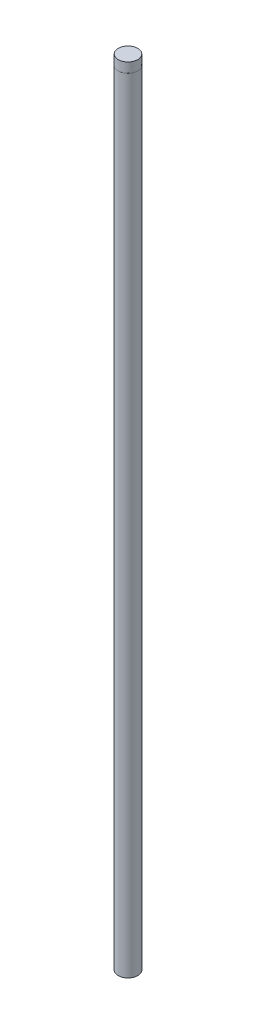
from build123d import *

# Parameters (mm, degrees)
SKETCH1_W = 4.99
SKETCH1_H = 5


with BuildPart() as part:
    # Sketch1 → Revolve1 (revolve)
    with BuildSketch(Plane.XY, mode=Mode.PRIVATE) as revolve1_sk:
        Polygon((0, 486), (5, 486), (5, 886), (4.99, 886), (0, 886), align=None)
        with Locations((2.495, 888.5)):
            Rectangle(SKETCH1_W, SKETCH1_H)
    revolve(revolve1_sk.sketch.rotate(Axis((0, 886, 0), (0, -1, 0)), 180), axis=Axis((0, 886, 0), (0, -1, 0)))


solid = part.part
